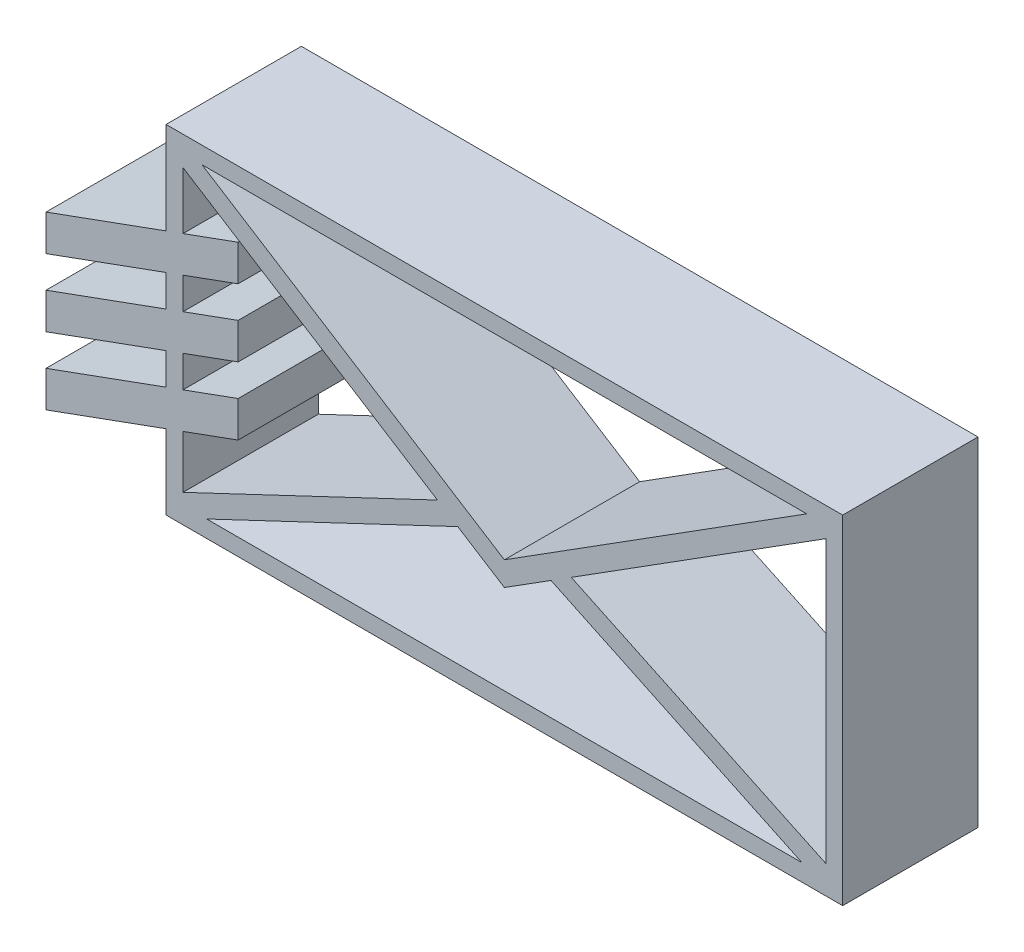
ISO-10303-21;
HEADER;
FILE_DESCRIPTION(('STEP AP214'),'2;1');
FILE_NAME('part.step','',(''),(''),'','','');
FILE_SCHEMA(('AUTOMOTIVE_DESIGN { 1 0 10303 214 1 1 1 1 }'));
ENDSEC;
DATA;
#1=APPLICATION_CONTEXT('core data for automotive mechanical design processes');
#2=APPLICATION_PROTOCOL_DEFINITION('international standard','automotive_design',2000,#1);
#3=PRODUCT_CONTEXT('',#1,'mechanical');
#4=PRODUCT('Part','Part','',(#3));
#5=PRODUCT_RELATED_PRODUCT_CATEGORY('part','',(#4));
#6=PRODUCT_DEFINITION_FORMATION('','',#4);
#7=PRODUCT_DEFINITION_CONTEXT('part definition',#1,'design');
#8=PRODUCT_DEFINITION('design','',#6,#7);
#9=PRODUCT_DEFINITION_SHAPE('','',#8);
#10=(LENGTH_UNIT() NAMED_UNIT(*) SI_UNIT(.MILLI.,.METRE.));
#11=(NAMED_UNIT(*) PLANE_ANGLE_UNIT() SI_UNIT($,.RADIAN.));
#12=(NAMED_UNIT(*) SI_UNIT($,.STERADIAN.) SOLID_ANGLE_UNIT());
#13=UNCERTAINTY_MEASURE_WITH_UNIT(LENGTH_MEASURE(1.E-05),#10,'distance_accuracy_value','');
#14=(GEOMETRIC_REPRESENTATION_CONTEXT(3) GLOBAL_UNCERTAINTY_ASSIGNED_CONTEXT((#13)) GLOBAL_UNIT_ASSIGNED_CONTEXT((#10,
#11,#12)) REPRESENTATION_CONTEXT('',''));
#15=CARTESIAN_POINT('',(0.,0.,0.));
#16=DIRECTION('',(0.,0.,1.));
#17=DIRECTION('',(1.,0.,0.));
#18=AXIS2_PLACEMENT_3D('',#15,#16,#17);
#19=CARTESIAN_POINT('',(-5.,-2.49999999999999,2.));
#20=DIRECTION('',(1.,0.,0.));
#21=DIRECTION('',(0.,0.,-1.));
#22=AXIS2_PLACEMENT_3D('',#19,#20,#21);
#23=PLANE('',#22);
#24=DIRECTION('',(0.,-1.,0.));
#25=VECTOR('',#24,1.);
#26=CARTESIAN_POINT('',(-5.,-2.49999999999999,2.));
#27=LINE('',#26,#25);
#28=CARTESIAN_POINT('',(-5.,0.604817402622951,2.));
#29=VERTEX_POINT('',#28);
#30=CARTESIAN_POINT('',(-5.,0.136906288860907,2.));
#31=VERTEX_POINT('',#30);
#32=EDGE_CURVE('E561',#29,#31,#27,.T.);
#33=ORIENTED_EDGE('',*,*,#32,.F.);
#34=DIRECTION('',(0.,0.,-1.));
#35=VECTOR('',#34,1.);
#36=CARTESIAN_POINT('',(-5.,0.604817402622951,2.));
#37=LINE('',#36,#35);
#38=CARTESIAN_POINT('',(-5.,0.604817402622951,0.));
#39=VERTEX_POINT('',#38);
#40=EDGE_CURVE('E354',#29,#39,#37,.T.);
#41=ORIENTED_EDGE('',*,*,#40,.T.);
#42=DIRECTION('',(0.,-1.,0.));
#43=VECTOR('',#42,1.);
#44=CARTESIAN_POINT('',(-5.,-2.49999999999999,0.));
#45=LINE('',#44,#43);
#46=CARTESIAN_POINT('',(-5.,0.136906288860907,0.));
#47=VERTEX_POINT('',#46);
#48=EDGE_CURVE('E573',#39,#47,#45,.T.);
#49=ORIENTED_EDGE('',*,*,#48,.T.);
#50=DIRECTION('',(0.,0.,1.));
#51=VECTOR('',#50,1.);
#52=CARTESIAN_POINT('',(-5.,0.136906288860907,2.));
#53=LINE('',#52,#51);
#54=EDGE_CURVE('E387',#47,#31,#53,.T.);
#55=ORIENTED_EDGE('',*,*,#54,.T.);
#56=EDGE_LOOP('',(#33,#41,#49,#55));
#57=FACE_BOUND('',#56,.T.);
#58=ADVANCED_FACE('F33',(#57),#23,.F.);
#59=CARTESIAN_POINT('',(-4.75,-2.24999999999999,2.));
#60=DIRECTION('',(1.,0.,0.));
#61=DIRECTION('',(0.,1.,0.));
#62=AXIS2_PLACEMENT_3D('',#59,#60,#61);
#63=PLANE('',#62);
#64=DIRECTION('',(0.,0.,-1.));
#65=VECTOR('',#64,1.);
#66=CARTESIAN_POINT('',(-4.75,0.6958099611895,2.));
#67=LINE('',#66,#65);
#68=CARTESIAN_POINT('',(-4.75,0.6958099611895,2.));
#69=VERTEX_POINT('',#68);
#70=CARTESIAN_POINT('',(-4.75,0.6958099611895,0.));
#71=VERTEX_POINT('',#70);
#72=EDGE_CURVE('E11',#69,#71,#67,.T.);
#73=ORIENTED_EDGE('',*,*,#72,.F.);
#74=DIRECTION('',(0.,-1.,0.));
#75=VECTOR('',#74,1.);
#76=CARTESIAN_POINT('',(-4.75,-2.24999999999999,2.));
#77=LINE('',#76,#75);
#78=CARTESIAN_POINT('',(-4.75,0.227898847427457,2.));
#79=VERTEX_POINT('',#78);
#80=EDGE_CURVE('E545',#69,#79,#77,.T.);
#81=ORIENTED_EDGE('',*,*,#80,.T.);
#82=DIRECTION('',(0.,0.,1.));
#83=VECTOR('',#82,1.);
#84=CARTESIAN_POINT('',(-4.75,0.227898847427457,2.));
#85=LINE('',#84,#83);
#86=CARTESIAN_POINT('',(-4.75,0.227898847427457,0.));
#87=VERTEX_POINT('',#86);
#88=EDGE_CURVE('E596',#87,#79,#85,.T.);
#89=ORIENTED_EDGE('',*,*,#88,.F.);
#90=DIRECTION('',(0.,-1.,0.));
#91=VECTOR('',#90,1.);
#92=CARTESIAN_POINT('',(-4.75,-2.24999999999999,0.));
#93=LINE('',#92,#91);
#94=EDGE_CURVE('E556',#71,#87,#93,.T.);
#95=ORIENTED_EDGE('',*,*,#94,.F.);
#96=EDGE_LOOP('',(#73,#81,#89,#95));
#97=FACE_BOUND('',#96,.T.);
#98=ADVANCED_FACE('F612',(#97),#63,.T.);
#99=CARTESIAN_POINT('',(-5.,-0.395182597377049,2.));
#100=VERTEX_POINT('',#99);
#101=CARTESIAN_POINT('',(-5.,-0.863093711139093,2.));
#102=VERTEX_POINT('',#101);
#103=EDGE_CURVE('E691',#100,#102,#27,.T.);
#104=ORIENTED_EDGE('',*,*,#103,.F.);
#105=DIRECTION('',(0.,0.,-1.));
#106=VECTOR('',#105,1.);
#107=CARTESIAN_POINT('',(-5.,-0.395182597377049,2.));
#108=LINE('',#107,#106);
#109=CARTESIAN_POINT('',(-5.,-0.395182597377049,0.));
#110=VERTEX_POINT('',#109);
#111=EDGE_CURVE('E396',#100,#110,#108,.T.);
#112=ORIENTED_EDGE('',*,*,#111,.T.);
#113=CARTESIAN_POINT('',(-5.,-0.863093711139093,0.));
#114=VERTEX_POINT('',#113);
#115=EDGE_CURVE('E704',#110,#114,#45,.T.);
#116=ORIENTED_EDGE('',*,*,#115,.T.);
#117=DIRECTION('',(0.,0.,1.));
#118=VECTOR('',#117,1.);
#119=CARTESIAN_POINT('',(-5.,-0.863093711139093,2.));
#120=LINE('',#119,#118);
#121=EDGE_CURVE('E429',#114,#102,#120,.T.);
#122=ORIENTED_EDGE('',*,*,#121,.T.);
#123=EDGE_LOOP('',(#104,#112,#116,#122));
#124=FACE_BOUND('',#123,.T.);
#125=ADVANCED_FACE('F661',(#124),#23,.F.);
#126=DIRECTION('',(0.,0.,-1.));
#127=VECTOR('',#126,1.);
#128=CARTESIAN_POINT('',(-4.75,-0.304190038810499,2.));
#129=LINE('',#128,#127);
#130=CARTESIAN_POINT('',(-4.75,-0.304190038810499,2.));
#131=VERTEX_POINT('',#130);
#132=CARTESIAN_POINT('',(-4.75,-0.304190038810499,0.));
#133=VERTEX_POINT('',#132);
#134=EDGE_CURVE('E599',#131,#133,#129,.T.);
#135=ORIENTED_EDGE('',*,*,#134,.F.);
#136=CARTESIAN_POINT('',(-4.75,-0.772101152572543,2.));
#137=VERTEX_POINT('',#136);
#138=EDGE_CURVE('E629',#131,#137,#77,.T.);
#139=ORIENTED_EDGE('',*,*,#138,.T.);
#140=DIRECTION('',(0.,0.,1.));
#141=VECTOR('',#140,1.);
#142=CARTESIAN_POINT('',(-4.75,-0.772101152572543,2.));
#143=LINE('',#142,#141);
#144=CARTESIAN_POINT('',(-4.75,-0.772101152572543,0.));
#145=VERTEX_POINT('',#144);
#146=EDGE_CURVE('E590',#145,#137,#143,.T.);
#147=ORIENTED_EDGE('',*,*,#146,.F.);
#148=EDGE_CURVE('E611',#133,#145,#93,.T.);
#149=ORIENTED_EDGE('',*,*,#148,.F.);
#150=EDGE_LOOP('',(#135,#139,#147,#149));
#151=FACE_BOUND('',#150,.T.);
#152=ADVANCED_FACE('F628',(#151),#63,.T.);
#153=CARTESIAN_POINT('',(-5.,-1.39518259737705,2.));
#154=VERTEX_POINT('',#153);
#155=CARTESIAN_POINT('',(-5.,-2.49999999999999,2.));
#156=VERTEX_POINT('',#155);
#157=EDGE_CURVE('E562',#154,#156,#27,.T.);
#158=ORIENTED_EDGE('',*,*,#157,.F.);
#159=DIRECTION('',(0.,0.,-1.));
#160=VECTOR('',#159,1.);
#161=CARTESIAN_POINT('',(-5.,-1.39518259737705,2.));
#162=LINE('',#161,#160);
#163=CARTESIAN_POINT('',(-5.,-1.39518259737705,0.));
#164=VERTEX_POINT('',#163);
#165=EDGE_CURVE('E438',#154,#164,#162,.T.);
#166=ORIENTED_EDGE('',*,*,#165,.T.);
#167=CARTESIAN_POINT('',(-5.,-2.49999999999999,0.));
#168=VERTEX_POINT('',#167);
#169=EDGE_CURVE('E544',#164,#168,#45,.T.);
#170=ORIENTED_EDGE('',*,*,#169,.T.);
#171=DIRECTION('',(0.,0.,-1.));
#172=VECTOR('',#171,1.);
#173=CARTESIAN_POINT('',(-5.,-2.49999999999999,2.));
#174=LINE('',#173,#172);
#175=EDGE_CURVE('E587',#156,#168,#174,.T.);
#176=ORIENTED_EDGE('',*,*,#175,.F.);
#177=EDGE_LOOP('',(#158,#166,#170,#176));
#178=FACE_BOUND('',#177,.T.);
#179=ADVANCED_FACE('F663',(#178),#23,.F.);
#180=DIRECTION('',(0.,0.,-1.));
#181=VECTOR('',#180,1.);
#182=CARTESIAN_POINT('',(-4.75,-1.3041900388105,2.));
#183=LINE('',#182,#181);
#184=CARTESIAN_POINT('',(-4.75,-1.3041900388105,2.));
#185=VERTEX_POINT('',#184);
#186=CARTESIAN_POINT('',(-4.75,-1.3041900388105,0.));
#187=VERTEX_POINT('',#186);
#188=EDGE_CURVE('E593',#185,#187,#183,.T.);
#189=ORIENTED_EDGE('',*,*,#188,.F.);
#190=CARTESIAN_POINT('',(-4.75,-2.08402266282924,2.));
#191=VERTEX_POINT('',#190);
#192=EDGE_CURVE('E542',#185,#191,#77,.T.);
#193=ORIENTED_EDGE('',*,*,#192,.T.);
#194=DIRECTION('',(0.,0.,1.));
#195=VECTOR('',#194,1.);
#196=CARTESIAN_POINT('',(-4.75,-2.08402266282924,0.));
#197=LINE('',#196,#195);
#198=CARTESIAN_POINT('',(-4.75,-2.08402266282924,0.));
#199=VERTEX_POINT('',#198);
#200=EDGE_CURVE('E522',#199,#191,#197,.T.);
#201=ORIENTED_EDGE('',*,*,#200,.F.);
#202=EDGE_CURVE('E554',#187,#199,#93,.T.);
#203=ORIENTED_EDGE('',*,*,#202,.F.);
#204=EDGE_LOOP('',(#189,#193,#201,#203));
#205=FACE_BOUND('',#204,.T.);
#206=ADVANCED_FACE('F636',(#205),#63,.T.);
#207=CARTESIAN_POINT('',(-5.,2.50000000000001,2.));
#208=DIRECTION('',(0.,0.,1.));
#209=DIRECTION('',(1.,0.,0.));
#210=AXIS2_PLACEMENT_3D('',#207,#208,#209);
#211=PLANE('',#210);
#212=ORIENTED_EDGE('',*,*,#80,.F.);
#213=DIRECTION('',(0.939692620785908,0.342020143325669,0.));
#214=VECTOR('',#213,1.);
#215=CARTESIAN_POINT('',(-6.77468147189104,-0.0411138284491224,2.));
#216=LINE('',#215,#214);
#217=CARTESIAN_POINT('',(-3.93496596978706,0.992458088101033,2.));
#218=VERTEX_POINT('',#217);
#219=EDGE_CURVE('E333',#69,#218,#216,.T.);
#220=ORIENTED_EDGE('',*,*,#219,.T.);
#221=DIRECTION('',(0.,1.,0.));
#222=VECTOR('',#221,1.);
#223=CARTESIAN_POINT('',(-3.93496596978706,0.992458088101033,2.));
#224=LINE('',#223,#222);
#225=CARTESIAN_POINT('',(-3.93496596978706,1.52454697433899,2.));
#226=VERTEX_POINT('',#225);
#227=EDGE_CURVE('E340',#218,#226,#224,.T.);
#228=ORIENTED_EDGE('',*,*,#227,.T.);
#229=DIRECTION('',(-0.939692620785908,-0.342020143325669,0.));
#230=VECTOR('',#229,1.);
#231=CARTESIAN_POINT('',(-6.77468147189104,0.490975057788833,2.));
#232=LINE('',#231,#230);
#233=CARTESIAN_POINT('',(-4.75,1.22789884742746,2.));
#234=VERTEX_POINT('',#233);
#235=EDGE_CURVE('E308',#226,#234,#232,.T.);
#236=ORIENTED_EDGE('',*,*,#235,.T.);
#237=CARTESIAN_POINT('',(-4.75000000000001,2.07258785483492,2.));
#238=VERTEX_POINT('',#237);
#239=EDGE_CURVE('E56',#238,#234,#77,.T.);
#240=ORIENTED_EDGE('',*,*,#239,.F.);
#241=DIRECTION('',(0.845488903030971,-0.533992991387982,0.));
#242=VECTOR('',#241,1.);
#243=CARTESIAN_POINT('',(-0.989257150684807,-0.302618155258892,2.));
#244=LINE('',#243,#242);
#245=CARTESIAN_POINT('',(-0.989257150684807,-0.302618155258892,2.));
#246=VERTEX_POINT('',#245);
#247=EDGE_CURVE('E479',#238,#246,#244,.T.);
#248=ORIENTED_EDGE('',*,*,#247,.T.);
#249=DIRECTION('',(-0.903737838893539,-0.428086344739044,0.));
#250=VECTOR('',#249,1.);
#251=CARTESIAN_POINT('',(-0.989257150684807,-0.302618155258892,2.));
#252=LINE('',#251,#250);
#253=EDGE_CURVE('E482',#246,#191,#252,.T.);
#254=ORIENTED_EDGE('',*,*,#253,.T.);
#255=ORIENTED_EDGE('',*,*,#192,.F.);
#256=DIRECTION('',(0.939692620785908,0.342020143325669,0.));
#257=VECTOR('',#256,1.);
#258=CARTESIAN_POINT('',(-6.77468147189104,-2.04111382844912,2.));
#259=LINE('',#258,#257);
#260=CARTESIAN_POINT('',(-3.93496596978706,-1.00754191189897,2.));
#261=VERTEX_POINT('',#260);
#262=EDGE_CURVE('E424',#185,#261,#259,.T.);
#263=ORIENTED_EDGE('',*,*,#262,.T.);
#264=DIRECTION('',(0.,1.,0.));
#265=VECTOR('',#264,1.);
#266=CARTESIAN_POINT('',(-3.93496596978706,-1.00754191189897,2.));
#267=LINE('',#266,#265);
#268=CARTESIAN_POINT('',(-3.93496596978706,-0.475453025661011,2.));
#269=VERTEX_POINT('',#268);
#270=EDGE_CURVE('E399',#261,#269,#267,.T.);
#271=ORIENTED_EDGE('',*,*,#270,.T.);
#272=DIRECTION('',(-0.939692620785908,-0.342020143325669,0.));
#273=VECTOR('',#272,1.);
#274=CARTESIAN_POINT('',(-6.77468147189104,-1.50902494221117,2.));
#275=LINE('',#274,#273);
#276=EDGE_CURVE('E418',#269,#137,#275,.T.);
#277=ORIENTED_EDGE('',*,*,#276,.T.);
#278=ORIENTED_EDGE('',*,*,#138,.F.);
#279=DIRECTION('',(0.939692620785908,0.342020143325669,0.));
#280=VECTOR('',#279,1.);
#281=CARTESIAN_POINT('',(-6.77468147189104,-1.04111382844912,2.));
#282=LINE('',#281,#280);
#283=CARTESIAN_POINT('',(-3.93496596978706,-0.00754191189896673,2.));
#284=VERTEX_POINT('',#283);
#285=EDGE_CURVE('E382',#131,#284,#282,.T.);
#286=ORIENTED_EDGE('',*,*,#285,.T.);
#287=DIRECTION('',(0.,1.,0.));
#288=VECTOR('',#287,1.);
#289=CARTESIAN_POINT('',(-3.93496596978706,-0.00754191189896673,2.));
#290=LINE('',#289,#288);
#291=CARTESIAN_POINT('',(-3.93496596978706,0.524546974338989,2.));
#292=VERTEX_POINT('',#291);
#293=EDGE_CURVE('E357',#284,#292,#290,.T.);
#294=ORIENTED_EDGE('',*,*,#293,.T.);
#295=DIRECTION('',(-0.939692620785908,-0.342020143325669,0.));
#296=VECTOR('',#295,1.);
#297=CARTESIAN_POINT('',(-6.77468147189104,-0.509024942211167,2.));
#298=LINE('',#297,#296);
#299=EDGE_CURVE('E376',#292,#79,#298,.T.);
#300=ORIENTED_EDGE('',*,*,#299,.T.);
#301=EDGE_LOOP('',(#212,#220,#228,#236,#240,#248,#254,#255,#263,#271,#277,#278,#286,#294,#300));
#302=FACE_BOUND('',#301,.T.);
#303=CARTESIAN_POINT('',(-6.77468147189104,-0.0411138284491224,2.));
#304=VERTEX_POINT('',#303);
#305=EDGE_CURVE('E48',#304,#29,#216,.T.);
#306=ORIENTED_EDGE('',*,*,#305,.T.);
#307=ORIENTED_EDGE('',*,*,#32,.T.);
#308=CARTESIAN_POINT('',(-6.77468147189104,-0.509024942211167,2.));
#309=VERTEX_POINT('',#308);
#310=EDGE_CURVE('E375',#31,#309,#298,.T.);
#311=ORIENTED_EDGE('',*,*,#310,.T.);
#312=DIRECTION('',(0.,-1.,0.));
#313=VECTOR('',#312,1.);
#314=CARTESIAN_POINT('',(-6.77468147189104,-0.509024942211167,2.));
#315=LINE('',#314,#313);
#316=CARTESIAN_POINT('',(-6.77468147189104,-1.04111382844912,2.));
#317=VERTEX_POINT('',#316);
#318=EDGE_CURVE('E379',#309,#317,#315,.T.);
#319=ORIENTED_EDGE('',*,*,#318,.T.);
#320=EDGE_CURVE('E362',#317,#100,#282,.T.);
#321=ORIENTED_EDGE('',*,*,#320,.T.);
#322=ORIENTED_EDGE('',*,*,#103,.T.);
#323=CARTESIAN_POINT('',(-6.77468147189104,-1.50902494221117,2.));
#324=VERTEX_POINT('',#323);
#325=EDGE_CURVE('E417',#102,#324,#275,.T.);
#326=ORIENTED_EDGE('',*,*,#325,.T.);
#327=DIRECTION('',(0.,-1.,0.));
#328=VECTOR('',#327,1.);
#329=CARTESIAN_POINT('',(-6.77468147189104,-1.50902494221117,2.));
#330=LINE('',#329,#328);
#331=CARTESIAN_POINT('',(-6.77468147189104,-2.04111382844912,2.));
#332=VERTEX_POINT('',#331);
#333=EDGE_CURVE('E421',#324,#332,#330,.T.);
#334=ORIENTED_EDGE('',*,*,#333,.T.);
#335=EDGE_CURVE('E404',#332,#154,#259,.T.);
#336=ORIENTED_EDGE('',*,*,#335,.T.);
#337=ORIENTED_EDGE('',*,*,#157,.T.);
#338=DIRECTION('',(1.,0.,0.));
#339=VECTOR('',#338,1.);
#340=CARTESIAN_POINT('',(5.00000000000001,-2.49999999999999,2.));
#341=LINE('',#340,#339);
#342=CARTESIAN_POINT('',(5.00000000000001,-2.49999999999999,2.));
#343=VERTEX_POINT('',#342);
#344=EDGE_CURVE('E560',#156,#343,#341,.T.);
#345=ORIENTED_EDGE('',*,*,#344,.T.);
#346=DIRECTION('',(0.,1.,0.));
#347=VECTOR('',#346,1.);
#348=CARTESIAN_POINT('',(5.00000000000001,-2.49999999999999,2.));
#349=LINE('',#348,#347);
#350=CARTESIAN_POINT('',(5.00000000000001,2.50000000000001,2.));
#351=VERTEX_POINT('',#350);
#352=EDGE_CURVE('E564',#343,#351,#349,.T.);
#353=ORIENTED_EDGE('',*,*,#352,.T.);
#354=DIRECTION('',(-1.,0.,0.));
#355=VECTOR('',#354,1.);
#356=CARTESIAN_POINT('',(5.00000000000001,2.50000000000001,2.));
#357=LINE('',#356,#355);
#358=CARTESIAN_POINT('',(-5.,2.50000000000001,2.));
#359=VERTEX_POINT('',#358);
#360=EDGE_CURVE('E566',#351,#359,#357,.T.);
#361=ORIENTED_EDGE('',*,*,#360,.T.);
#362=CARTESIAN_POINT('',(-5.,1.13690628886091,2.));
#363=VERTEX_POINT('',#362);
#364=EDGE_CURVE('E557',#359,#363,#27,.T.);
#365=ORIENTED_EDGE('',*,*,#364,.T.);
#366=CARTESIAN_POINT('',(-6.77468147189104,0.490975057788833,2.));
#367=VERTEX_POINT('',#366);
#368=EDGE_CURVE('E342',#363,#367,#232,.T.);
#369=ORIENTED_EDGE('',*,*,#368,.T.);
#370=DIRECTION('',(0.,-1.,0.));
#371=VECTOR('',#370,1.);
#372=CARTESIAN_POINT('',(-6.77468147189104,0.490975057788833,2.));
#373=LINE('',#372,#371);
#374=EDGE_CURVE('E344',#367,#304,#373,.T.);
#375=ORIENTED_EDGE('',*,*,#374,.T.);
#376=EDGE_LOOP('',(#306,#307,#311,#319,#321,#322,#326,#334,#336,#337,#345,#353,#361,#365,#369,#375));
#377=FACE_BOUND('',#376,.T.);
#378=DIRECTION('',(1.,0.,0.));
#379=VECTOR('',#378,1.);
#380=CARTESIAN_POINT('',(4.75,-2.24999999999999,2.));
#381=LINE('',#380,#379);
#382=CARTESIAN_POINT('',(-4.39960339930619,-2.24999999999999,2.));
#383=VERTEX_POINT('',#382);
#384=CARTESIAN_POINT('',(4.39960339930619,-2.24999999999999,2.));
#385=VERTEX_POINT('',#384);
#386=EDGE_CURVE('E536',#383,#385,#381,.T.);
#387=ORIENTED_EDGE('',*,*,#386,.F.);
#388=DIRECTION('',(0.903737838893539,0.428086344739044,0.));
#389=VECTOR('',#388,1.);
#390=CARTESIAN_POINT('',(-0.688917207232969,-0.492306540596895,2.));
#391=LINE('',#390,#389);
#392=CARTESIAN_POINT('',(-0.688917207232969,-0.492306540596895,2.));
#393=VERTEX_POINT('',#392);
#394=EDGE_CURVE('E485',#383,#393,#391,.T.);
#395=ORIENTED_EDGE('',*,*,#394,.T.);
#396=DIRECTION('',(0.845488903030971,-0.533992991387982,0.));
#397=VECTOR('',#396,1.);
#398=CARTESIAN_POINT('',(0.,-0.927412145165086,2.));
#399=LINE('',#398,#397);
#400=CARTESIAN_POINT('',(0.,-0.927412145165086,2.));
#401=VERTEX_POINT('',#400);
#402=EDGE_CURVE('E488',#393,#401,#399,.T.);
#403=ORIENTED_EDGE('',*,*,#402,.T.);
#404=DIRECTION('',(0.845488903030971,0.533992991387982,0.));
#405=VECTOR('',#404,1.);
#406=CARTESIAN_POINT('',(0.,-0.927412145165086,2.));
#407=LINE('',#406,#405);
#408=CARTESIAN_POINT('',(0.688917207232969,-0.492306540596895,2.));
#409=VERTEX_POINT('',#408);
#410=EDGE_CURVE('E491',#401,#409,#407,.T.);
#411=ORIENTED_EDGE('',*,*,#410,.T.);
#412=DIRECTION('',(0.903737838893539,-0.428086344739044,0.));
#413=VECTOR('',#412,1.);
#414=CARTESIAN_POINT('',(0.688917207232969,-0.492306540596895,2.));
#415=LINE('',#414,#413);
#416=EDGE_CURVE('E494',#409,#385,#415,.T.);
#417=ORIENTED_EDGE('',*,*,#416,.T.);
#418=EDGE_LOOP('',(#387,#395,#403,#411,#417));
#419=FACE_BOUND('',#418,.T.);
#420=DIRECTION('',(0.,1.,0.));
#421=VECTOR('',#420,1.);
#422=CARTESIAN_POINT('',(4.75,-2.24999999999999,2.));
#423=LINE('',#422,#421);
#424=CARTESIAN_POINT('',(4.75,-2.08402266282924,2.));
#425=VERTEX_POINT('',#424);
#426=CARTESIAN_POINT('',(4.75000000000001,2.07258785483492,2.));
#427=VERTEX_POINT('',#426);
#428=EDGE_CURVE('E538',#425,#427,#423,.T.);
#429=ORIENTED_EDGE('',*,*,#428,.F.);
#430=DIRECTION('',(-0.903737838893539,0.428086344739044,0.));
#431=VECTOR('',#430,1.);
#432=CARTESIAN_POINT('',(0.989257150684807,-0.302618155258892,2.));
#433=LINE('',#432,#431);
#434=CARTESIAN_POINT('',(0.989257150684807,-0.302618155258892,2.));
#435=VERTEX_POINT('',#434);
#436=EDGE_CURVE('E497',#425,#435,#433,.T.);
#437=ORIENTED_EDGE('',*,*,#436,.T.);
#438=DIRECTION('',(0.845488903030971,0.533992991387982,0.));
#439=VECTOR('',#438,1.);
#440=CARTESIAN_POINT('',(0.989257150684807,-0.302618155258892,2.));
#441=LINE('',#440,#439);
#442=EDGE_CURVE('E446',#435,#427,#441,.T.);
#443=ORIENTED_EDGE('',*,*,#442,.T.);
#444=EDGE_LOOP('',(#429,#437,#443));
#445=FACE_BOUND('',#444,.T.);
#446=DIRECTION('',(-1.,0.,0.));
#447=VECTOR('',#446,1.);
#448=CARTESIAN_POINT('',(4.75000000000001,2.25000000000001,2.));
#449=LINE('',#448,#447);
#450=CARTESIAN_POINT('',(4.46909743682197,2.25000000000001,2.));
#451=VERTEX_POINT('',#450);
#452=CARTESIAN_POINT('',(-4.46909743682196,2.25000000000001,2.));
#453=VERTEX_POINT('',#452);
#454=EDGE_CURVE('E540',#451,#453,#449,.T.);
#455=ORIENTED_EDGE('',*,*,#454,.F.);
#456=DIRECTION('',(-0.845488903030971,-0.533992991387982,0.));
#457=VECTOR('',#456,1.);
#458=CARTESIAN_POINT('',(0.,-0.572587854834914,2.));
#459=LINE('',#458,#457);
#460=CARTESIAN_POINT('',(0.,-0.572587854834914,2.));
#461=VERTEX_POINT('',#460);
#462=EDGE_CURVE('E441',#451,#461,#459,.T.);
#463=ORIENTED_EDGE('',*,*,#462,.T.);
#464=DIRECTION('',(-0.845488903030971,0.533992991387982,0.));
#465=VECTOR('',#464,1.);
#466=CARTESIAN_POINT('',(0.,-0.572587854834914,2.));
#467=LINE('',#466,#465);
#468=EDGE_CURVE('E476',#461,#453,#467,.T.);
#469=ORIENTED_EDGE('',*,*,#468,.T.);
#470=EDGE_LOOP('',(#455,#463,#469));
#471=FACE_BOUND('',#470,.T.);
#472=ADVANCED_FACE('F602',(#302,#377,#419,#445,#471),#211,.T.);
#473=CARTESIAN_POINT('',(-5.,2.50000000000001,0.));
#474=DIRECTION('',(0.,0.,1.));
#475=DIRECTION('',(1.,0.,0.));
#476=AXIS2_PLACEMENT_3D('',#473,#474,#475);
#477=PLANE('',#476);
#478=DIRECTION('',(0.939692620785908,0.342020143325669,0.));
#479=VECTOR('',#478,1.);
#480=CARTESIAN_POINT('',(-6.77468147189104,-0.0411138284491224,0.));
#481=LINE('',#480,#479);
#482=CARTESIAN_POINT('',(-3.93496596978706,0.992458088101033,0.));
#483=VERTEX_POINT('',#482);
#484=EDGE_CURVE('E338',#71,#483,#481,.T.);
#485=ORIENTED_EDGE('',*,*,#484,.F.);
#486=ORIENTED_EDGE('',*,*,#94,.T.);
#487=DIRECTION('',(-0.939692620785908,-0.342020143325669,0.));
#488=VECTOR('',#487,1.);
#489=CARTESIAN_POINT('',(-6.77468147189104,-0.509024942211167,0.));
#490=LINE('',#489,#488);
#491=CARTESIAN_POINT('',(-3.93496596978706,0.524546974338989,0.));
#492=VERTEX_POINT('',#491);
#493=EDGE_CURVE('E363',#492,#87,#490,.T.);
#494=ORIENTED_EDGE('',*,*,#493,.F.);
#495=DIRECTION('',(0.,1.,0.));
#496=VECTOR('',#495,1.);
#497=CARTESIAN_POINT('',(-3.93496596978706,-0.00754191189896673,0.));
#498=LINE('',#497,#496);
#499=CARTESIAN_POINT('',(-3.93496596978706,-0.00754191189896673,0.));
#500=VERTEX_POINT('',#499);
#501=EDGE_CURVE('E358',#500,#492,#498,.T.);
#502=ORIENTED_EDGE('',*,*,#501,.F.);
#503=DIRECTION('',(0.939692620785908,0.342020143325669,0.));
#504=VECTOR('',#503,1.);
#505=CARTESIAN_POINT('',(-6.77468147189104,-1.04111382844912,0.));
#506=LINE('',#505,#504);
#507=EDGE_CURVE('E369',#133,#500,#506,.T.);
#508=ORIENTED_EDGE('',*,*,#507,.F.);
#509=ORIENTED_EDGE('',*,*,#148,.T.);
#510=DIRECTION('',(-0.939692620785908,-0.342020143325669,0.));
#511=VECTOR('',#510,1.);
#512=CARTESIAN_POINT('',(-6.77468147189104,-1.50902494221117,0.));
#513=LINE('',#512,#511);
#514=CARTESIAN_POINT('',(-3.93496596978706,-0.475453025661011,0.));
#515=VERTEX_POINT('',#514);
#516=EDGE_CURVE('E405',#515,#145,#513,.T.);
#517=ORIENTED_EDGE('',*,*,#516,.F.);
#518=DIRECTION('',(0.,1.,0.));
#519=VECTOR('',#518,1.);
#520=CARTESIAN_POINT('',(-3.93496596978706,-1.00754191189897,0.));
#521=LINE('',#520,#519);
#522=CARTESIAN_POINT('',(-3.93496596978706,-1.00754191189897,0.));
#523=VERTEX_POINT('',#522);
#524=EDGE_CURVE('E400',#523,#515,#521,.T.);
#525=ORIENTED_EDGE('',*,*,#524,.F.);
#526=DIRECTION('',(0.939692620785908,0.342020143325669,0.));
#527=VECTOR('',#526,1.);
#528=CARTESIAN_POINT('',(-6.77468147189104,-2.04111382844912,0.));
#529=LINE('',#528,#527);
#530=EDGE_CURVE('E411',#187,#523,#529,.T.);
#531=ORIENTED_EDGE('',*,*,#530,.F.);
#532=ORIENTED_EDGE('',*,*,#202,.T.);
#533=DIRECTION('',(-0.903737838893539,-0.428086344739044,0.));
#534=VECTOR('',#533,1.);
#535=CARTESIAN_POINT('',(-0.989257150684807,-0.302618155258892,0.));
#536=LINE('',#535,#534);
#537=CARTESIAN_POINT('',(-0.989257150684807,-0.302618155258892,0.));
#538=VERTEX_POINT('',#537);
#539=EDGE_CURVE('E452',#538,#199,#536,.T.);
#540=ORIENTED_EDGE('',*,*,#539,.F.);
#541=DIRECTION('',(0.845488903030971,-0.533992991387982,0.));
#542=VECTOR('',#541,1.);
#543=CARTESIAN_POINT('',(-0.989257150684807,-0.302618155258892,0.));
#544=LINE('',#543,#542);
#545=CARTESIAN_POINT('',(-4.75,2.07258785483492,0.));
#546=VERTEX_POINT('',#545);
#547=EDGE_CURVE('E449',#546,#538,#544,.T.);
#548=ORIENTED_EDGE('',*,*,#547,.F.);
#549=CARTESIAN_POINT('',(-4.75,1.22789884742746,0.));
#550=VERTEX_POINT('',#549);
#551=EDGE_CURVE('E324',#546,#550,#93,.T.);
#552=ORIENTED_EDGE('',*,*,#551,.T.);
#553=DIRECTION('',(-0.939692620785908,-0.342020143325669,0.));
#554=VECTOR('',#553,1.);
#555=CARTESIAN_POINT('',(-6.77468147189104,0.490975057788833,0.));
#556=LINE('',#555,#554);
#557=CARTESIAN_POINT('',(-3.93496596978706,1.52454697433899,0.));
#558=VERTEX_POINT('',#557);
#559=EDGE_CURVE('E306',#558,#550,#556,.T.);
#560=ORIENTED_EDGE('',*,*,#559,.F.);
#561=DIRECTION('',(0.,1.,0.));
#562=VECTOR('',#561,1.);
#563=CARTESIAN_POINT('',(-3.93496596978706,0.992458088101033,0.));
#564=LINE('',#563,#562);
#565=EDGE_CURVE('E322',#483,#558,#564,.T.);
#566=ORIENTED_EDGE('',*,*,#565,.F.);
#567=EDGE_LOOP('',(#485,#486,#494,#502,#508,#509,#517,#525,#531,#532,#540,#548,#552,#560,#566));
#568=FACE_BOUND('',#567,.T.);
#569=ORIENTED_EDGE('',*,*,#48,.F.);
#570=CARTESIAN_POINT('',(-6.77468147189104,-0.0411138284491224,0.));
#571=VERTEX_POINT('',#570);
#572=EDGE_CURVE('E314',#571,#39,#481,.T.);
#573=ORIENTED_EDGE('',*,*,#572,.F.);
#574=DIRECTION('',(0.,-1.,0.));
#575=VECTOR('',#574,1.);
#576=CARTESIAN_POINT('',(-6.77468147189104,0.490975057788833,0.));
#577=LINE('',#576,#575);
#578=CARTESIAN_POINT('',(-6.77468147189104,0.490975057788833,0.));
#579=VERTEX_POINT('',#578);
#580=EDGE_CURVE('E325',#579,#571,#577,.T.);
#581=ORIENTED_EDGE('',*,*,#580,.F.);
#582=CARTESIAN_POINT('',(-5.,1.13690628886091,0.));
#583=VERTEX_POINT('',#582);
#584=EDGE_CURVE('E326',#583,#579,#556,.T.);
#585=ORIENTED_EDGE('',*,*,#584,.F.);
#586=CARTESIAN_POINT('',(-5.,2.50000000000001,0.));
#587=VERTEX_POINT('',#586);
#588=EDGE_CURVE('E569',#587,#583,#45,.T.);
#589=ORIENTED_EDGE('',*,*,#588,.F.);
#590=DIRECTION('',(-1.,0.,0.));
#591=VECTOR('',#590,1.);
#592=CARTESIAN_POINT('',(5.00000000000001,2.50000000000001,0.));
#593=LINE('',#592,#591);
#594=CARTESIAN_POINT('',(5.00000000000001,2.50000000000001,0.));
#595=VERTEX_POINT('',#594);
#596=EDGE_CURVE('E577',#595,#587,#593,.T.);
#597=ORIENTED_EDGE('',*,*,#596,.F.);
#598=DIRECTION('',(0.,1.,0.));
#599=VECTOR('',#598,1.);
#600=CARTESIAN_POINT('',(5.00000000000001,-2.49999999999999,0.));
#601=LINE('',#600,#599);
#602=CARTESIAN_POINT('',(5.00000000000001,-2.49999999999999,0.));
#603=VERTEX_POINT('',#602);
#604=EDGE_CURVE('E575',#603,#595,#601,.T.);
#605=ORIENTED_EDGE('',*,*,#604,.F.);
#606=DIRECTION('',(1.,0.,0.));
#607=VECTOR('',#606,1.);
#608=CARTESIAN_POINT('',(5.00000000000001,-2.49999999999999,0.));
#609=LINE('',#608,#607);
#610=EDGE_CURVE('E572',#168,#603,#609,.T.);
#611=ORIENTED_EDGE('',*,*,#610,.F.);
#612=ORIENTED_EDGE('',*,*,#169,.F.);
#613=CARTESIAN_POINT('',(-6.77468147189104,-2.04111382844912,0.));
#614=VERTEX_POINT('',#613);
#615=EDGE_CURVE('E412',#614,#164,#529,.T.);
#616=ORIENTED_EDGE('',*,*,#615,.F.);
#617=DIRECTION('',(0.,-1.,0.));
#618=VECTOR('',#617,1.);
#619=CARTESIAN_POINT('',(-6.77468147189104,-1.50902494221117,0.));
#620=LINE('',#619,#618);
#621=CARTESIAN_POINT('',(-6.77468147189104,-1.50902494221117,0.));
#622=VERTEX_POINT('',#621);
#623=EDGE_CURVE('E408',#622,#614,#620,.T.);
#624=ORIENTED_EDGE('',*,*,#623,.F.);
#625=EDGE_CURVE('E403',#114,#622,#513,.T.);
#626=ORIENTED_EDGE('',*,*,#625,.F.);
#627=ORIENTED_EDGE('',*,*,#115,.F.);
#628=CARTESIAN_POINT('',(-6.77468147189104,-1.04111382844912,0.));
#629=VERTEX_POINT('',#628);
#630=EDGE_CURVE('E370',#629,#110,#506,.T.);
#631=ORIENTED_EDGE('',*,*,#630,.F.);
#632=DIRECTION('',(0.,-1.,0.));
#633=VECTOR('',#632,1.);
#634=CARTESIAN_POINT('',(-6.77468147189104,-0.509024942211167,0.));
#635=LINE('',#634,#633);
#636=CARTESIAN_POINT('',(-6.77468147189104,-0.509024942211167,0.));
#637=VERTEX_POINT('',#636);
#638=EDGE_CURVE('E366',#637,#629,#635,.T.);
#639=ORIENTED_EDGE('',*,*,#638,.F.);
#640=EDGE_CURVE('E361',#47,#637,#490,.T.);
#641=ORIENTED_EDGE('',*,*,#640,.F.);
#642=EDGE_LOOP('',(#569,#573,#581,#585,#589,#597,#605,#611,#612,#616,#624,#626,#627,#631,#639,#641));
#643=FACE_BOUND('',#642,.T.);
#644=DIRECTION('',(0.903737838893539,0.428086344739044,0.));
#645=VECTOR('',#644,1.);
#646=CARTESIAN_POINT('',(-0.688917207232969,-0.492306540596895,0.));
#647=LINE('',#646,#645);
#648=CARTESIAN_POINT('',(-4.39960339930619,-2.24999999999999,0.));
#649=VERTEX_POINT('',#648);
#650=CARTESIAN_POINT('',(-0.688917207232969,-0.492306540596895,0.));
#651=VERTEX_POINT('',#650);
#652=EDGE_CURVE('E455',#649,#651,#647,.T.);
#653=ORIENTED_EDGE('',*,*,#652,.F.);
#654=DIRECTION('',(1.,0.,0.));
#655=VECTOR('',#654,1.);
#656=CARTESIAN_POINT('',(4.75,-2.24999999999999,0.));
#657=LINE('',#656,#655);
#658=CARTESIAN_POINT('',(4.39960339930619,-2.24999999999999,0.));
#659=VERTEX_POINT('',#658);
#660=EDGE_CURVE('E505',#649,#659,#657,.T.);
#661=ORIENTED_EDGE('',*,*,#660,.T.);
#662=DIRECTION('',(0.903737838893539,-0.428086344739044,0.));
#663=VECTOR('',#662,1.);
#664=CARTESIAN_POINT('',(0.688917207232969,-0.492306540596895,0.));
#665=LINE('',#664,#663);
#666=CARTESIAN_POINT('',(0.688917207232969,-0.492306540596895,0.));
#667=VERTEX_POINT('',#666);
#668=EDGE_CURVE('E464',#667,#659,#665,.T.);
#669=ORIENTED_EDGE('',*,*,#668,.F.);
#670=DIRECTION('',(0.845488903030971,0.533992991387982,0.));
#671=VECTOR('',#670,1.);
#672=CARTESIAN_POINT('',(0.,-0.927412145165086,0.));
#673=LINE('',#672,#671);
#674=CARTESIAN_POINT('',(0.,-0.927412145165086,0.));
#675=VERTEX_POINT('',#674);
#676=EDGE_CURVE('E461',#675,#667,#673,.T.);
#677=ORIENTED_EDGE('',*,*,#676,.F.);
#678=DIRECTION('',(0.845488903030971,-0.533992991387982,0.));
#679=VECTOR('',#678,1.);
#680=CARTESIAN_POINT('',(0.,-0.927412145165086,0.));
#681=LINE('',#680,#679);
#682=EDGE_CURVE('E458',#651,#675,#681,.T.);
#683=ORIENTED_EDGE('',*,*,#682,.F.);
#684=EDGE_LOOP('',(#653,#661,#669,#677,#683));
#685=FACE_BOUND('',#684,.T.);
#686=DIRECTION('',(-0.903737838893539,0.428086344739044,0.));
#687=VECTOR('',#686,1.);
#688=CARTESIAN_POINT('',(0.989257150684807,-0.302618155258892,0.));
#689=LINE('',#688,#687);
#690=CARTESIAN_POINT('',(4.75,-2.08402266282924,0.));
#691=VERTEX_POINT('',#690);
#692=CARTESIAN_POINT('',(0.989257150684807,-0.302618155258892,0.));
#693=VERTEX_POINT('',#692);
#694=EDGE_CURVE('E467',#691,#693,#689,.T.);
#695=ORIENTED_EDGE('',*,*,#694,.F.);
#696=DIRECTION('',(0.,1.,0.));
#697=VECTOR('',#696,1.);
#698=CARTESIAN_POINT('',(4.75,-2.24999999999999,0.));
#699=LINE('',#698,#697);
#700=CARTESIAN_POINT('',(4.75000000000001,2.07258785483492,0.));
#701=VERTEX_POINT('',#700);
#702=EDGE_CURVE('E548',#691,#701,#699,.T.);
#703=ORIENTED_EDGE('',*,*,#702,.T.);
#704=DIRECTION('',(0.845488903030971,0.533992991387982,0.));
#705=VECTOR('',#704,1.);
#706=CARTESIAN_POINT('',(0.989257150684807,-0.302618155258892,0.));
#707=LINE('',#706,#705);
#708=EDGE_CURVE('E470',#693,#701,#707,.T.);
#709=ORIENTED_EDGE('',*,*,#708,.F.);
#710=EDGE_LOOP('',(#695,#703,#709));
#711=FACE_BOUND('',#710,.T.);
#712=DIRECTION('',(-0.845488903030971,-0.533992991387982,0.));
#713=VECTOR('',#712,1.);
#714=CARTESIAN_POINT('',(0.,-0.572587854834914,0.));
#715=LINE('',#714,#713);
#716=CARTESIAN_POINT('',(4.46909743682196,2.25000000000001,0.));
#717=VERTEX_POINT('',#716);
#718=CARTESIAN_POINT('',(0.,-0.572587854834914,0.));
#719=VERTEX_POINT('',#718);
#720=EDGE_CURVE('E442',#717,#719,#715,.T.);
#721=ORIENTED_EDGE('',*,*,#720,.F.);
#722=DIRECTION('',(-1.,0.,0.));
#723=VECTOR('',#722,1.);
#724=CARTESIAN_POINT('',(4.75000000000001,2.25000000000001,0.));
#725=LINE('',#724,#723);
#726=CARTESIAN_POINT('',(-4.46909743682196,2.25000000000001,0.));
#727=VERTEX_POINT('',#726);
#728=EDGE_CURVE('E551',#717,#727,#725,.T.);
#729=ORIENTED_EDGE('',*,*,#728,.T.);
#730=DIRECTION('',(-0.845488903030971,0.533992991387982,0.));
#731=VECTOR('',#730,1.);
#732=CARTESIAN_POINT('',(0.,-0.572587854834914,0.));
#733=LINE('',#732,#731);
#734=EDGE_CURVE('E445',#719,#727,#733,.T.);
#735=ORIENTED_EDGE('',*,*,#734,.F.);
#736=EDGE_LOOP('',(#721,#729,#735));
#737=FACE_BOUND('',#736,.T.);
#738=ADVANCED_FACE('F320',(#568,#643,#685,#711,#737),#477,.F.);
#739=ORIENTED_EDGE('',*,*,#588,.T.);
#740=DIRECTION('',(0.,0.,1.));
#741=VECTOR('',#740,1.);
#742=CARTESIAN_POINT('',(-5.,1.13690628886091,2.));
#743=LINE('',#742,#741);
#744=EDGE_CURVE('E347',#583,#363,#743,.T.);
#745=ORIENTED_EDGE('',*,*,#744,.T.);
#746=ORIENTED_EDGE('',*,*,#364,.F.);
#747=DIRECTION('',(0.,0.,-1.));
#748=VECTOR('',#747,1.);
#749=CARTESIAN_POINT('',(-5.,2.50000000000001,2.));
#750=LINE('',#749,#748);
#751=EDGE_CURVE('E568',#359,#587,#750,.T.);
#752=ORIENTED_EDGE('',*,*,#751,.T.);
#753=EDGE_LOOP('',(#739,#745,#746,#752));
#754=FACE_BOUND('',#753,.T.);
#755=ADVANCED_FACE('F35',(#754),#23,.F.);
#756=CARTESIAN_POINT('',(5.00000000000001,-2.49999999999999,2.));
#757=DIRECTION('',(0.,1.,0.));
#758=DIRECTION('',(-1.,0.,0.));
#759=AXIS2_PLACEMENT_3D('',#756,#757,#758);
#760=PLANE('',#759);
#761=ORIENTED_EDGE('',*,*,#610,.T.);
#762=DIRECTION('',(0.,0.,-1.));
#763=VECTOR('',#762,1.);
#764=CARTESIAN_POINT('',(5.00000000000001,-2.49999999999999,2.));
#765=LINE('',#764,#763);
#766=EDGE_CURVE('E584',#343,#603,#765,.T.);
#767=ORIENTED_EDGE('',*,*,#766,.F.);
#768=ORIENTED_EDGE('',*,*,#344,.F.);
#769=ORIENTED_EDGE('',*,*,#175,.T.);
#770=EDGE_LOOP('',(#761,#767,#768,#769));
#771=FACE_BOUND('',#770,.T.);
#772=ADVANCED_FACE('F672',(#771),#760,.F.);
#773=CARTESIAN_POINT('',(5.00000000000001,-2.49999999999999,2.));
#774=DIRECTION('',(-1.,0.,0.));
#775=DIRECTION('',(0.,0.,1.));
#776=AXIS2_PLACEMENT_3D('',#773,#774,#775);
#777=PLANE('',#776);
#778=ORIENTED_EDGE('',*,*,#604,.T.);
#779=DIRECTION('',(0.,0.,-1.));
#780=VECTOR('',#779,1.);
#781=CARTESIAN_POINT('',(5.00000000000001,2.50000000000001,2.));
#782=LINE('',#781,#780);
#783=EDGE_CURVE('E581',#351,#595,#782,.T.);
#784=ORIENTED_EDGE('',*,*,#783,.F.);
#785=ORIENTED_EDGE('',*,*,#352,.F.);
#786=ORIENTED_EDGE('',*,*,#766,.T.);
#787=EDGE_LOOP('',(#778,#784,#785,#786));
#788=FACE_BOUND('',#787,.T.);
#789=ADVANCED_FACE('F678',(#788),#777,.F.);
#790=CARTESIAN_POINT('',(5.00000000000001,2.50000000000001,2.));
#791=DIRECTION('',(0.,-1.,0.));
#792=DIRECTION('',(1.,0.,0.));
#793=AXIS2_PLACEMENT_3D('',#790,#791,#792);
#794=PLANE('',#793);
#795=ORIENTED_EDGE('',*,*,#596,.T.);
#796=ORIENTED_EDGE('',*,*,#751,.F.);
#797=ORIENTED_EDGE('',*,*,#360,.F.);
#798=ORIENTED_EDGE('',*,*,#783,.T.);
#799=EDGE_LOOP('',(#795,#796,#797,#798));
#800=FACE_BOUND('',#799,.T.);
#801=ADVANCED_FACE('F719',(#800),#794,.F.);
#802=CARTESIAN_POINT('',(4.75,-2.24999999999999,2.));
#803=DIRECTION('',(0.,1.,0.));
#804=DIRECTION('',(-1.,0.,0.));
#805=AXIS2_PLACEMENT_3D('',#802,#803,#804);
#806=PLANE('',#805);
#807=DIRECTION('',(0.,0.,1.));
#808=VECTOR('',#807,1.);
#809=CARTESIAN_POINT('',(4.39960339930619,-2.24999999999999,0.));
#810=LINE('',#809,#808);
#811=EDGE_CURVE('E511',#659,#385,#810,.T.);
#812=ORIENTED_EDGE('',*,*,#811,.F.);
#813=ORIENTED_EDGE('',*,*,#660,.F.);
#814=DIRECTION('',(0.,0.,1.));
#815=VECTOR('',#814,1.);
#816=CARTESIAN_POINT('',(-4.39960339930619,-2.25,0.));
#817=LINE('',#816,#815);
#818=EDGE_CURVE('E520',#649,#383,#817,.T.);
#819=ORIENTED_EDGE('',*,*,#818,.T.);
#820=ORIENTED_EDGE('',*,*,#386,.T.);
#821=EDGE_LOOP('',(#812,#813,#819,#820));
#822=FACE_BOUND('',#821,.T.);
#823=ADVANCED_FACE('F817',(#822),#806,.T.);
#824=CARTESIAN_POINT('',(4.75,-2.24999999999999,2.));
#825=DIRECTION('',(-1.,0.,0.));
#826=DIRECTION('',(0.,-1.,0.));
#827=AXIS2_PLACEMENT_3D('',#824,#825,#826);
#828=PLANE('',#827);
#829=DIRECTION('',(0.,0.,1.));
#830=VECTOR('',#829,1.);
#831=CARTESIAN_POINT('',(4.75000000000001,2.07258785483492,0.));
#832=LINE('',#831,#830);
#833=EDGE_CURVE('E502',#701,#427,#832,.T.);
#834=ORIENTED_EDGE('',*,*,#833,.F.);
#835=ORIENTED_EDGE('',*,*,#702,.F.);
#836=DIRECTION('',(0.,0.,1.));
#837=VECTOR('',#836,1.);
#838=CARTESIAN_POINT('',(4.75,-2.08402266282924,0.));
#839=LINE('',#838,#837);
#840=EDGE_CURVE('E508',#691,#425,#839,.T.);
#841=ORIENTED_EDGE('',*,*,#840,.T.);
#842=ORIENTED_EDGE('',*,*,#428,.T.);
#843=EDGE_LOOP('',(#834,#835,#841,#842));
#844=FACE_BOUND('',#843,.T.);
#845=ADVANCED_FACE('F656',(#844),#828,.T.);
#846=CARTESIAN_POINT('',(4.75000000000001,2.25000000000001,2.));
#847=DIRECTION('',(0.,-1.,0.));
#848=DIRECTION('',(1.,0.,0.));
#849=AXIS2_PLACEMENT_3D('',#846,#847,#848);
#850=PLANE('',#849);
#851=DIRECTION('',(0.,0.,1.));
#852=VECTOR('',#851,1.);
#853=CARTESIAN_POINT('',(-4.46909743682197,2.25000000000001,0.));
#854=LINE('',#853,#852);
#855=EDGE_CURVE('E529',#727,#453,#854,.T.);
#856=ORIENTED_EDGE('',*,*,#855,.F.);
#857=ORIENTED_EDGE('',*,*,#728,.F.);
#858=DIRECTION('',(0.,0.,1.));
#859=VECTOR('',#858,1.);
#860=CARTESIAN_POINT('',(4.46909743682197,2.25000000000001,0.));
#861=LINE('',#860,#859);
#862=EDGE_CURVE('E473',#717,#451,#861,.T.);
#863=ORIENTED_EDGE('',*,*,#862,.T.);
#864=ORIENTED_EDGE('',*,*,#454,.T.);
#865=EDGE_LOOP('',(#856,#857,#863,#864));
#866=FACE_BOUND('',#865,.T.);
#867=ADVANCED_FACE('F647',(#866),#850,.T.);
#868=DIRECTION('',(0.,0.,1.));
#869=VECTOR('',#868,1.);
#870=CARTESIAN_POINT('',(-4.75,1.22789884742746,2.));
#871=LINE('',#870,#869);
#872=EDGE_CURVE('E41',#550,#234,#871,.T.);
#873=ORIENTED_EDGE('',*,*,#872,.F.);
#874=ORIENTED_EDGE('',*,*,#551,.F.);
#875=DIRECTION('',(0.,0.,1.));
#876=VECTOR('',#875,1.);
#877=CARTESIAN_POINT('',(-4.75000000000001,2.07258785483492,0.));
#878=LINE('',#877,#876);
#879=EDGE_CURVE('E527',#546,#238,#878,.T.);
#880=ORIENTED_EDGE('',*,*,#879,.T.);
#881=ORIENTED_EDGE('',*,*,#239,.T.);
#882=EDGE_LOOP('',(#873,#874,#880,#881));
#883=FACE_BOUND('',#882,.T.);
#884=ADVANCED_FACE('F644',(#883),#63,.T.);
#885=CARTESIAN_POINT('',(0.989257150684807,-0.302618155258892,0.));
#886=DIRECTION('',(0.533992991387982,-0.845488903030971,0.));
#887=DIRECTION('',(0.845488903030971,0.533992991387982,0.));
#888=AXIS2_PLACEMENT_3D('',#885,#886,#887);
#889=PLANE('',#888);
#890=ORIENTED_EDGE('',*,*,#442,.F.);
#891=DIRECTION('',(0.,0.,1.));
#892=VECTOR('',#891,1.);
#893=CARTESIAN_POINT('',(0.989257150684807,-0.302618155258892,0.));
#894=LINE('',#893,#892);
#895=EDGE_CURVE('E506',#693,#435,#894,.T.);
#896=ORIENTED_EDGE('',*,*,#895,.F.);
#897=ORIENTED_EDGE('',*,*,#708,.T.);
#898=ORIENTED_EDGE('',*,*,#833,.T.);
#899=EDGE_LOOP('',(#890,#896,#897,#898));
#900=FACE_BOUND('',#899,.T.);
#901=ADVANCED_FACE('F646',(#900),#889,.T.);
#902=CARTESIAN_POINT('',(0.989257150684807,-0.302618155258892,0.));
#903=DIRECTION('',(0.428086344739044,0.903737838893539,0.));
#904=DIRECTION('',(-0.903737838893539,0.428086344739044,0.));
#905=AXIS2_PLACEMENT_3D('',#902,#903,#904);
#906=PLANE('',#905);
#907=ORIENTED_EDGE('',*,*,#436,.F.);
#908=ORIENTED_EDGE('',*,*,#840,.F.);
#909=ORIENTED_EDGE('',*,*,#694,.T.);
#910=ORIENTED_EDGE('',*,*,#895,.T.);
#911=EDGE_LOOP('',(#907,#908,#909,#910));
#912=FACE_BOUND('',#911,.T.);
#913=ADVANCED_FACE('F653',(#912),#906,.T.);
#914=CARTESIAN_POINT('',(0.688917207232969,-0.492306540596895,0.));
#915=DIRECTION('',(-0.428086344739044,-0.903737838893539,0.));
#916=DIRECTION('',(0.903737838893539,-0.428086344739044,0.));
#917=AXIS2_PLACEMENT_3D('',#914,#915,#916);
#918=PLANE('',#917);
#919=ORIENTED_EDGE('',*,*,#416,.F.);
#920=DIRECTION('',(0.,0.,1.));
#921=VECTOR('',#920,1.);
#922=CARTESIAN_POINT('',(0.688917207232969,-0.492306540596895,0.));
#923=LINE('',#922,#921);
#924=EDGE_CURVE('E514',#667,#409,#923,.T.);
#925=ORIENTED_EDGE('',*,*,#924,.F.);
#926=ORIENTED_EDGE('',*,*,#668,.T.);
#927=ORIENTED_EDGE('',*,*,#811,.T.);
#928=EDGE_LOOP('',(#919,#925,#926,#927));
#929=FACE_BOUND('',#928,.T.);
#930=ADVANCED_FACE('F777',(#929),#918,.T.);
#931=CARTESIAN_POINT('',(0.,-0.927412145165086,0.));
#932=DIRECTION('',(0.533992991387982,-0.845488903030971,0.));
#933=DIRECTION('',(0.845488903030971,0.533992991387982,0.));
#934=AXIS2_PLACEMENT_3D('',#931,#932,#933);
#935=PLANE('',#934);
#936=ORIENTED_EDGE('',*,*,#410,.F.);
#937=DIRECTION('',(0.,0.,1.));
#938=VECTOR('',#937,1.);
#939=CARTESIAN_POINT('',(0.,-0.927412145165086,0.));
#940=LINE('',#939,#938);
#941=EDGE_CURVE('E516',#675,#401,#940,.T.);
#942=ORIENTED_EDGE('',*,*,#941,.F.);
#943=ORIENTED_EDGE('',*,*,#676,.T.);
#944=ORIENTED_EDGE('',*,*,#924,.T.);
#945=EDGE_LOOP('',(#936,#942,#943,#944));
#946=FACE_BOUND('',#945,.T.);
#947=ADVANCED_FACE('F781',(#946),#935,.T.);
#948=CARTESIAN_POINT('',(0.,-0.927412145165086,0.));
#949=DIRECTION('',(-0.533992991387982,-0.845488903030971,0.));
#950=DIRECTION('',(0.845488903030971,-0.533992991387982,0.));
#951=AXIS2_PLACEMENT_3D('',#948,#949,#950);
#952=PLANE('',#951);
#953=ORIENTED_EDGE('',*,*,#402,.F.);
#954=DIRECTION('',(0.,0.,1.));
#955=VECTOR('',#954,1.);
#956=CARTESIAN_POINT('',(-0.688917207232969,-0.492306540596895,0.));
#957=LINE('',#956,#955);
#958=EDGE_CURVE('E518',#651,#393,#957,.T.);
#959=ORIENTED_EDGE('',*,*,#958,.F.);
#960=ORIENTED_EDGE('',*,*,#682,.T.);
#961=ORIENTED_EDGE('',*,*,#941,.T.);
#962=EDGE_LOOP('',(#953,#959,#960,#961));
#963=FACE_BOUND('',#962,.T.);
#964=ADVANCED_FACE('F785',(#963),#952,.T.);
#965=CARTESIAN_POINT('',(-0.688917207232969,-0.492306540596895,0.));
#966=DIRECTION('',(0.428086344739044,-0.903737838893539,0.));
#967=DIRECTION('',(0.903737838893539,0.428086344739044,0.));
#968=AXIS2_PLACEMENT_3D('',#965,#966,#967);
#969=PLANE('',#968);
#970=ORIENTED_EDGE('',*,*,#394,.F.);
#971=ORIENTED_EDGE('',*,*,#818,.F.);
#972=ORIENTED_EDGE('',*,*,#652,.T.);
#973=ORIENTED_EDGE('',*,*,#958,.T.);
#974=EDGE_LOOP('',(#970,#971,#972,#973));
#975=FACE_BOUND('',#974,.T.);
#976=ADVANCED_FACE('F789',(#975),#969,.T.);
#977=CARTESIAN_POINT('',(-0.989257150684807,-0.302618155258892,0.));
#978=DIRECTION('',(-0.428086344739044,0.903737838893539,0.));
#979=DIRECTION('',(-0.903737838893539,-0.428086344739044,0.));
#980=AXIS2_PLACEMENT_3D('',#977,#978,#979);
#981=PLANE('',#980);
#982=ORIENTED_EDGE('',*,*,#253,.F.);
#983=DIRECTION('',(0.,0.,1.));
#984=VECTOR('',#983,1.);
#985=CARTESIAN_POINT('',(-0.989257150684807,-0.302618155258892,0.));
#986=LINE('',#985,#984);
#987=EDGE_CURVE('E525',#538,#246,#986,.T.);
#988=ORIENTED_EDGE('',*,*,#987,.F.);
#989=ORIENTED_EDGE('',*,*,#539,.T.);
#990=ORIENTED_EDGE('',*,*,#200,.T.);
#991=EDGE_LOOP('',(#982,#988,#989,#990));
#992=FACE_BOUND('',#991,.T.);
#993=ADVANCED_FACE('F639',(#992),#981,.T.);
#994=CARTESIAN_POINT('',(-0.989257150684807,-0.302618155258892,0.));
#995=DIRECTION('',(-0.533992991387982,-0.845488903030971,0.));
#996=DIRECTION('',(0.845488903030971,-0.533992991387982,0.));
#997=AXIS2_PLACEMENT_3D('',#994,#995,#996);
#998=PLANE('',#997);
#999=ORIENTED_EDGE('',*,*,#247,.F.);
#1000=ORIENTED_EDGE('',*,*,#879,.F.);
#1001=ORIENTED_EDGE('',*,*,#547,.T.);
#1002=ORIENTED_EDGE('',*,*,#987,.T.);
#1003=EDGE_LOOP('',(#999,#1000,#1001,#1002));
#1004=FACE_BOUND('',#1003,.T.);
#1005=ADVANCED_FACE('F642',(#1004),#998,.T.);
#1006=CARTESIAN_POINT('',(0.,-0.572587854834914,0.));
#1007=DIRECTION('',(0.533992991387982,0.845488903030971,0.));
#1008=DIRECTION('',(-0.845488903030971,0.533992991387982,0.));
#1009=AXIS2_PLACEMENT_3D('',#1006,#1007,#1008);
#1010=PLANE('',#1009);
#1011=ORIENTED_EDGE('',*,*,#468,.F.);
#1012=DIRECTION('',(0.,0.,1.));
#1013=VECTOR('',#1012,1.);
#1014=CARTESIAN_POINT('',(0.,-0.572587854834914,0.));
#1015=LINE('',#1014,#1013);
#1016=EDGE_CURVE('E532',#719,#461,#1015,.T.);
#1017=ORIENTED_EDGE('',*,*,#1016,.F.);
#1018=ORIENTED_EDGE('',*,*,#734,.T.);
#1019=ORIENTED_EDGE('',*,*,#855,.T.);
#1020=EDGE_LOOP('',(#1011,#1017,#1018,#1019));
#1021=FACE_BOUND('',#1020,.T.);
#1022=ADVANCED_FACE('F798',(#1021),#1010,.T.);
#1023=CARTESIAN_POINT('',(0.,-0.572587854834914,0.));
#1024=DIRECTION('',(-0.533992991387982,0.845488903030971,0.));
#1025=DIRECTION('',(-0.845488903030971,-0.533992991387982,0.));
#1026=AXIS2_PLACEMENT_3D('',#1023,#1024,#1025);
#1027=PLANE('',#1026);
#1028=ORIENTED_EDGE('',*,*,#462,.F.);
#1029=ORIENTED_EDGE('',*,*,#862,.F.);
#1030=ORIENTED_EDGE('',*,*,#720,.T.);
#1031=ORIENTED_EDGE('',*,*,#1016,.T.);
#1032=EDGE_LOOP('',(#1028,#1029,#1030,#1031));
#1033=FACE_BOUND('',#1032,.T.);
#1034=ADVANCED_FACE('F772',(#1033),#1027,.T.);
#1035=CARTESIAN_POINT('',(-3.93496596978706,-1.00754191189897,0.));
#1036=DIRECTION('',(1.,0.,0.));
#1037=DIRECTION('',(0.,1.,0.));
#1038=AXIS2_PLACEMENT_3D('',#1035,#1036,#1037);
#1039=PLANE('',#1038);
#1040=ORIENTED_EDGE('',*,*,#270,.F.);
#1041=DIRECTION('',(0.,0.,1.));
#1042=VECTOR('',#1041,1.);
#1043=CARTESIAN_POINT('',(-3.93496596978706,-1.00754191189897,0.));
#1044=LINE('',#1043,#1042);
#1045=EDGE_CURVE('E426',#523,#261,#1044,.T.);
#1046=ORIENTED_EDGE('',*,*,#1045,.F.);
#1047=ORIENTED_EDGE('',*,*,#524,.T.);
#1048=DIRECTION('',(0.,0.,1.));
#1049=VECTOR('',#1048,1.);
#1050=CARTESIAN_POINT('',(-3.93496596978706,-0.475453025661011,0.));
#1051=LINE('',#1050,#1049);
#1052=EDGE_CURVE('E414',#515,#269,#1051,.T.);
#1053=ORIENTED_EDGE('',*,*,#1052,.T.);
#1054=EDGE_LOOP('',(#1040,#1046,#1047,#1053));
#1055=FACE_BOUND('',#1054,.T.);
#1056=ADVANCED_FACE('F769',(#1055),#1039,.T.);
#1057=CARTESIAN_POINT('',(-6.77468147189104,-1.50902494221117,0.));
#1058=DIRECTION('',(-0.342020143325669,0.939692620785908,0.));
#1059=DIRECTION('',(-0.939692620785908,-0.342020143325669,0.));
#1060=AXIS2_PLACEMENT_3D('',#1057,#1058,#1059);
#1061=PLANE('',#1060);
#1062=ORIENTED_EDGE('',*,*,#516,.T.);
#1063=ORIENTED_EDGE('',*,*,#146,.T.);
#1064=ORIENTED_EDGE('',*,*,#276,.F.);
#1065=ORIENTED_EDGE('',*,*,#1052,.F.);
#1066=EDGE_LOOP('',(#1062,#1063,#1064,#1065));
#1067=FACE_BOUND('',#1066,.T.);
#1068=ADVANCED_FACE('F761',(#1067),#1061,.T.);
#1069=CARTESIAN_POINT('',(-6.77468147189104,-2.04111382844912,0.));
#1070=DIRECTION('',(0.342020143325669,-0.939692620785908,0.));
#1071=DIRECTION('',(0.939692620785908,0.342020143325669,0.));
#1072=AXIS2_PLACEMENT_3D('',#1069,#1070,#1071);
#1073=PLANE('',#1072);
#1074=ORIENTED_EDGE('',*,*,#262,.F.);
#1075=ORIENTED_EDGE('',*,*,#188,.T.);
#1076=ORIENTED_EDGE('',*,*,#530,.T.);
#1077=ORIENTED_EDGE('',*,*,#1045,.T.);
#1078=EDGE_LOOP('',(#1074,#1075,#1076,#1077));
#1079=FACE_BOUND('',#1078,.T.);
#1080=ADVANCED_FACE('F757',(#1079),#1073,.T.);
#1081=ORIENTED_EDGE('',*,*,#165,.F.);
#1082=ORIENTED_EDGE('',*,*,#335,.F.);
#1083=DIRECTION('',(0.,0.,1.));
#1084=VECTOR('',#1083,1.);
#1085=CARTESIAN_POINT('',(-6.77468147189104,-2.04111382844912,0.));
#1086=LINE('',#1085,#1084);
#1087=EDGE_CURVE('E430',#614,#332,#1086,.T.);
#1088=ORIENTED_EDGE('',*,*,#1087,.F.);
#1089=ORIENTED_EDGE('',*,*,#615,.T.);
#1090=EDGE_LOOP('',(#1081,#1082,#1088,#1089));
#1091=FACE_BOUND('',#1090,.T.);
#1092=ADVANCED_FACE('F760',(#1091),#1073,.T.);
#1093=ORIENTED_EDGE('',*,*,#121,.F.);
#1094=ORIENTED_EDGE('',*,*,#625,.T.);
#1095=DIRECTION('',(0.,0.,1.));
#1096=VECTOR('',#1095,1.);
#1097=CARTESIAN_POINT('',(-6.77468147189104,-1.50902494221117,0.));
#1098=LINE('',#1097,#1096);
#1099=EDGE_CURVE('E432',#622,#324,#1098,.T.);
#1100=ORIENTED_EDGE('',*,*,#1099,.T.);
#1101=ORIENTED_EDGE('',*,*,#325,.F.);
#1102=EDGE_LOOP('',(#1093,#1094,#1100,#1101));
#1103=FACE_BOUND('',#1102,.T.);
#1104=ADVANCED_FACE('F765',(#1103),#1061,.T.);
#1105=CARTESIAN_POINT('',(-6.77468147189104,-1.50902494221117,0.));
#1106=DIRECTION('',(-1.,0.,0.));
#1107=DIRECTION('',(0.,0.,1.));
#1108=AXIS2_PLACEMENT_3D('',#1105,#1106,#1107);
#1109=PLANE('',#1108);
#1110=ORIENTED_EDGE('',*,*,#333,.F.);
#1111=ORIENTED_EDGE('',*,*,#1099,.F.);
#1112=ORIENTED_EDGE('',*,*,#623,.T.);
#1113=ORIENTED_EDGE('',*,*,#1087,.T.);
#1114=EDGE_LOOP('',(#1110,#1111,#1112,#1113));
#1115=FACE_BOUND('',#1114,.T.);
#1116=ADVANCED_FACE('F756',(#1115),#1109,.T.);
#1117=CARTESIAN_POINT('',(-3.93496596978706,-0.00754191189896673,0.));
#1118=DIRECTION('',(1.,0.,0.));
#1119=DIRECTION('',(0.,1.,0.));
#1120=AXIS2_PLACEMENT_3D('',#1117,#1118,#1119);
#1121=PLANE('',#1120);
#1122=ORIENTED_EDGE('',*,*,#293,.F.);
#1123=DIRECTION('',(0.,0.,1.));
#1124=VECTOR('',#1123,1.);
#1125=CARTESIAN_POINT('',(-3.93496596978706,-0.00754191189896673,0.));
#1126=LINE('',#1125,#1124);
#1127=EDGE_CURVE('E384',#500,#284,#1126,.T.);
#1128=ORIENTED_EDGE('',*,*,#1127,.F.);
#1129=ORIENTED_EDGE('',*,*,#501,.T.);
#1130=DIRECTION('',(0.,0.,1.));
#1131=VECTOR('',#1130,1.);
#1132=CARTESIAN_POINT('',(-3.93496596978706,0.524546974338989,0.));
#1133=LINE('',#1132,#1131);
#1134=EDGE_CURVE('E372',#492,#292,#1133,.T.);
#1135=ORIENTED_EDGE('',*,*,#1134,.T.);
#1136=EDGE_LOOP('',(#1122,#1128,#1129,#1135));
#1137=FACE_BOUND('',#1136,.T.);
#1138=ADVANCED_FACE('F618',(#1137),#1121,.T.);
#1139=CARTESIAN_POINT('',(-6.77468147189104,-0.509024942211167,0.));
#1140=DIRECTION('',(-0.342020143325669,0.939692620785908,0.));
#1141=DIRECTION('',(-0.939692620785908,-0.342020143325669,0.));
#1142=AXIS2_PLACEMENT_3D('',#1139,#1140,#1141);
#1143=PLANE('',#1142);
#1144=ORIENTED_EDGE('',*,*,#493,.T.);
#1145=ORIENTED_EDGE('',*,*,#88,.T.);
#1146=ORIENTED_EDGE('',*,*,#299,.F.);
#1147=ORIENTED_EDGE('',*,*,#1134,.F.);
#1148=EDGE_LOOP('',(#1144,#1145,#1146,#1147));
#1149=FACE_BOUND('',#1148,.T.);
#1150=ADVANCED_FACE('F615',(#1149),#1143,.T.);
#1151=CARTESIAN_POINT('',(-6.77468147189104,-1.04111382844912,0.));
#1152=DIRECTION('',(0.342020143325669,-0.939692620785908,0.));
#1153=DIRECTION('',(0.939692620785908,0.342020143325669,0.));
#1154=AXIS2_PLACEMENT_3D('',#1151,#1152,#1153);
#1155=PLANE('',#1154);
#1156=ORIENTED_EDGE('',*,*,#285,.F.);
#1157=ORIENTED_EDGE('',*,*,#134,.T.);
#1158=ORIENTED_EDGE('',*,*,#507,.T.);
#1159=ORIENTED_EDGE('',*,*,#1127,.T.);
#1160=EDGE_LOOP('',(#1156,#1157,#1158,#1159));
#1161=FACE_BOUND('',#1160,.T.);
#1162=ADVANCED_FACE('F625',(#1161),#1155,.T.);
#1163=ORIENTED_EDGE('',*,*,#111,.F.);
#1164=ORIENTED_EDGE('',*,*,#320,.F.);
#1165=DIRECTION('',(0.,0.,1.));
#1166=VECTOR('',#1165,1.);
#1167=CARTESIAN_POINT('',(-6.77468147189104,-1.04111382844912,0.));
#1168=LINE('',#1167,#1166);
#1169=EDGE_CURVE('E388',#629,#317,#1168,.T.);
#1170=ORIENTED_EDGE('',*,*,#1169,.F.);
#1171=ORIENTED_EDGE('',*,*,#630,.T.);
#1172=EDGE_LOOP('',(#1163,#1164,#1170,#1171));
#1173=FACE_BOUND('',#1172,.T.);
#1174=ADVANCED_FACE('F748',(#1173),#1155,.T.);
#1175=ORIENTED_EDGE('',*,*,#54,.F.);
#1176=ORIENTED_EDGE('',*,*,#640,.T.);
#1177=DIRECTION('',(0.,0.,1.));
#1178=VECTOR('',#1177,1.);
#1179=CARTESIAN_POINT('',(-6.77468147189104,-0.509024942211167,0.));
#1180=LINE('',#1179,#1178);
#1181=EDGE_CURVE('E390',#637,#309,#1180,.T.);
#1182=ORIENTED_EDGE('',*,*,#1181,.T.);
#1183=ORIENTED_EDGE('',*,*,#310,.F.);
#1184=EDGE_LOOP('',(#1175,#1176,#1182,#1183));
#1185=FACE_BOUND('',#1184,.T.);
#1186=ADVANCED_FACE('F698',(#1185),#1143,.T.);
#1187=CARTESIAN_POINT('',(-6.77468147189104,-0.509024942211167,0.));
#1188=DIRECTION('',(-1.,0.,0.));
#1189=DIRECTION('',(0.,0.,1.));
#1190=AXIS2_PLACEMENT_3D('',#1187,#1188,#1189);
#1191=PLANE('',#1190);
#1192=ORIENTED_EDGE('',*,*,#318,.F.);
#1193=ORIENTED_EDGE('',*,*,#1181,.F.);
#1194=ORIENTED_EDGE('',*,*,#638,.T.);
#1195=ORIENTED_EDGE('',*,*,#1169,.T.);
#1196=EDGE_LOOP('',(#1192,#1193,#1194,#1195));
#1197=FACE_BOUND('',#1196,.T.);
#1198=ADVANCED_FACE('F745',(#1197),#1191,.T.);
#1199=CARTESIAN_POINT('',(-3.93496596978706,0.992458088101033,0.));
#1200=DIRECTION('',(1.,0.,0.));
#1201=DIRECTION('',(0.,1.,0.));
#1202=AXIS2_PLACEMENT_3D('',#1199,#1200,#1201);
#1203=PLANE('',#1202);
#1204=ORIENTED_EDGE('',*,*,#227,.F.);
#1205=DIRECTION('',(0.,0.,1.));
#1206=VECTOR('',#1205,1.);
#1207=CARTESIAN_POINT('',(-3.93496596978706,0.992458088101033,0.));
#1208=LINE('',#1207,#1206);
#1209=EDGE_CURVE('E331',#483,#218,#1208,.T.);
#1210=ORIENTED_EDGE('',*,*,#1209,.F.);
#1211=ORIENTED_EDGE('',*,*,#565,.T.);
#1212=DIRECTION('',(0.,0.,1.));
#1213=VECTOR('',#1212,1.);
#1214=CARTESIAN_POINT('',(-3.93496596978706,1.52454697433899,0.));
#1215=LINE('',#1214,#1213);
#1216=EDGE_CURVE('E303',#558,#226,#1215,.T.);
#1217=ORIENTED_EDGE('',*,*,#1216,.T.);
#1218=EDGE_LOOP('',(#1204,#1210,#1211,#1217));
#1219=FACE_BOUND('',#1218,.T.);
#1220=ADVANCED_FACE('F329',(#1219),#1203,.T.);
#1221=CARTESIAN_POINT('',(-6.77468147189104,0.490975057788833,0.));
#1222=DIRECTION('',(-0.342020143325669,0.939692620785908,0.));
#1223=DIRECTION('',(-0.939692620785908,-0.342020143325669,0.));
#1224=AXIS2_PLACEMENT_3D('',#1221,#1222,#1223);
#1225=PLANE('',#1224);
#1226=ORIENTED_EDGE('',*,*,#559,.T.);
#1227=ORIENTED_EDGE('',*,*,#872,.T.);
#1228=ORIENTED_EDGE('',*,*,#235,.F.);
#1229=ORIENTED_EDGE('',*,*,#1216,.F.);
#1230=EDGE_LOOP('',(#1226,#1227,#1228,#1229));
#1231=FACE_BOUND('',#1230,.T.);
#1232=ADVANCED_FACE('F305',(#1231),#1225,.T.);
#1233=CARTESIAN_POINT('',(-6.77468147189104,-0.0411138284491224,0.));
#1234=DIRECTION('',(0.342020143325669,-0.939692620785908,0.));
#1235=DIRECTION('',(0.939692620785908,0.342020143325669,0.));
#1236=AXIS2_PLACEMENT_3D('',#1233,#1234,#1235);
#1237=PLANE('',#1236);
#1238=ORIENTED_EDGE('',*,*,#219,.F.);
#1239=ORIENTED_EDGE('',*,*,#72,.T.);
#1240=ORIENTED_EDGE('',*,*,#484,.T.);
#1241=ORIENTED_EDGE('',*,*,#1209,.T.);
#1242=EDGE_LOOP('',(#1238,#1239,#1240,#1241));
#1243=FACE_BOUND('',#1242,.T.);
#1244=ADVANCED_FACE('F606',(#1243),#1237,.T.);
#1245=ORIENTED_EDGE('',*,*,#40,.F.);
#1246=ORIENTED_EDGE('',*,*,#305,.F.);
#1247=DIRECTION('',(0.,0.,1.));
#1248=VECTOR('',#1247,1.);
#1249=CARTESIAN_POINT('',(-6.77468147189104,-0.0411138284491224,0.));
#1250=LINE('',#1249,#1248);
#1251=EDGE_CURVE('E348',#571,#304,#1250,.T.);
#1252=ORIENTED_EDGE('',*,*,#1251,.F.);
#1253=ORIENTED_EDGE('',*,*,#572,.T.);
#1254=EDGE_LOOP('',(#1245,#1246,#1252,#1253));
#1255=FACE_BOUND('',#1254,.T.);
#1256=ADVANCED_FACE('F731',(#1255),#1237,.T.);
#1257=ORIENTED_EDGE('',*,*,#744,.F.);
#1258=ORIENTED_EDGE('',*,*,#584,.T.);
#1259=DIRECTION('',(0.,0.,1.));
#1260=VECTOR('',#1259,1.);
#1261=CARTESIAN_POINT('',(-6.77468147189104,0.490975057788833,0.));
#1262=LINE('',#1261,#1260);
#1263=EDGE_CURVE('E313',#579,#367,#1262,.T.);
#1264=ORIENTED_EDGE('',*,*,#1263,.T.);
#1265=ORIENTED_EDGE('',*,*,#368,.F.);
#1266=EDGE_LOOP('',(#1257,#1258,#1264,#1265));
#1267=FACE_BOUND('',#1266,.T.);
#1268=ADVANCED_FACE('F725',(#1267),#1225,.T.);
#1269=CARTESIAN_POINT('',(-6.77468147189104,0.490975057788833,0.));
#1270=DIRECTION('',(-1.,0.,0.));
#1271=DIRECTION('',(0.,0.,1.));
#1272=AXIS2_PLACEMENT_3D('',#1269,#1270,#1271);
#1273=PLANE('',#1272);
#1274=ORIENTED_EDGE('',*,*,#374,.F.);
#1275=ORIENTED_EDGE('',*,*,#1263,.F.);
#1276=ORIENTED_EDGE('',*,*,#580,.T.);
#1277=ORIENTED_EDGE('',*,*,#1251,.T.);
#1278=EDGE_LOOP('',(#1274,#1275,#1276,#1277));
#1279=FACE_BOUND('',#1278,.T.);
#1280=ADVANCED_FACE('F729',(#1279),#1273,.T.);
#1281=CLOSED_SHELL('',(#58,#98,#125,#152,#179,#206,#472,#738,#755,#772,#789,#801,#823,#845,#867,
#884,#901,#913,#930,#947,#964,#976,#993,#1005,#1022,#1034,#1056,#1068,#1080,#1092,#1104,#1116,
#1138,#1150,#1162,#1174,#1186,#1198,#1220,#1232,#1244,#1256,#1268,#1280));
#1282=MANIFOLD_SOLID_BREP('B2',#1281);
#1283=ADVANCED_BREP_SHAPE_REPRESENTATION('',(#18,#1282),#14);
#1284=SHAPE_DEFINITION_REPRESENTATION(#9,#1283);
ENDSEC;
END-ISO-10303-21;
